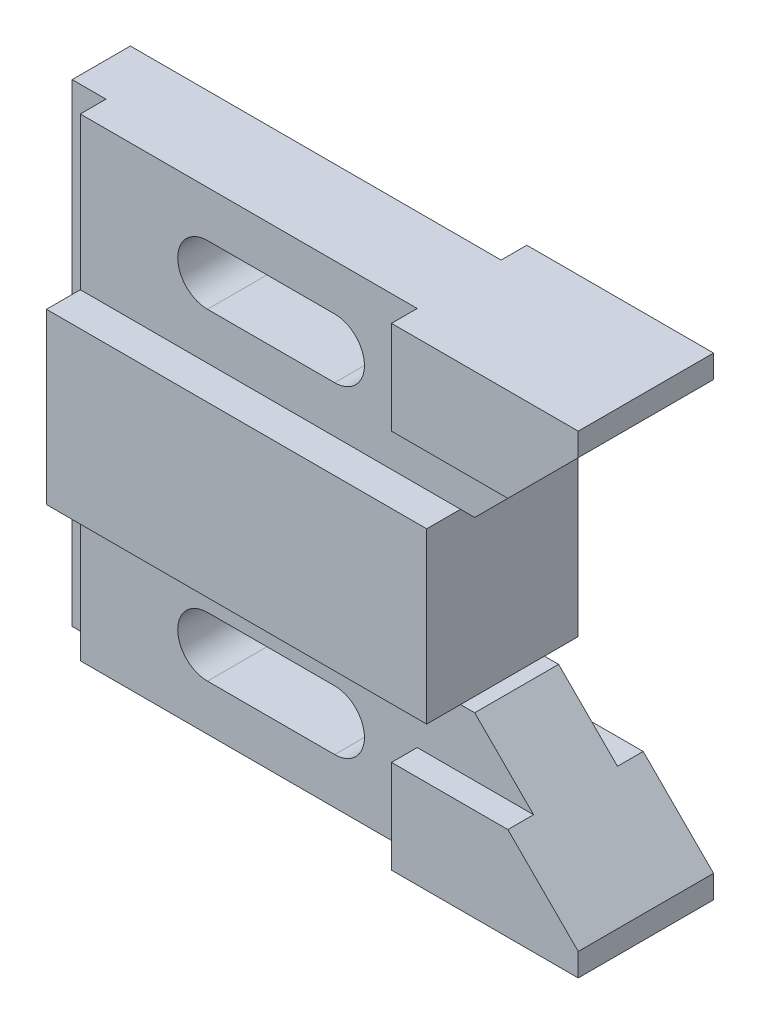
from build123d import *

# Parameters (mm, degrees)
BOSS_EXTRUDE1_DEPTH = 7.874
BOSS_EXTRUDE2_DEPTH = 4.826
SKETCH3_W           = 6.35
SKETCH3_H           = 88.9
CUT_EXTRUDE1_DEPTH  = 4.826
SKETCH4_W           = 71.374
SKETCH4_H           = 31.75
BOSS_EXTRUDE3_DEPTH = 6.35
SKETCH5_W           = 6.35
SKETCH5_H           = 31.75
BOSS_EXTRUDE4_DEPTH = 6.35


with BuildPart() as part:
    # Sketch1 → Boss-Extrude1 (new body)
    with BuildSketch(Plane.XY):
        Polygon((0, 0), (0, -88.9), (104.648, -88.9), (104.648, -84.582531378), (80.390468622, -60.325), (77.724, -60.325), (77.724, -44.45), (77.724, -28.575), (80.390468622, -28.575), (104.648, -4.317468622), (104.648, 0), align=None)
        with BuildLine():
            Line((30.226, -8.636), (54.102, -8.636))
            ThreePointArc((54.102, -8.636), (59.69, -14.224), (54.102, -19.812))
            Line((54.102, -19.812), (30.226, -19.812))
            ThreePointArc((30.226, -19.812), (24.638, -14.224), (30.226, -8.636))
        make_face(mode=Mode.SUBTRACT)
        with BuildLine():
            Line((30.226, -69.088), (54.102, -69.088))
            ThreePointArc((54.102, -69.088), (59.69, -74.676), (54.102, -80.264))
            Line((54.102, -80.264), (30.226, -80.264))
            ThreePointArc((30.226, -80.264), (24.638, -74.676), (30.226, -69.088))
        make_face(mode=Mode.SUBTRACT)
    boss_extrude1 = extrude(amount=BOSS_EXTRUDE1_DEPTH)

    # Sketch2 → Boss-Extrude2 (add)
    with BuildSketch(Plane.XY.offset(7.874)):
        Polygon((69.596, 0), (69.596, -17.526), (91.439468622, -17.526), (104.648, -4.317468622), (104.648, 0), align=None)
        Polygon((69.596, -71.374), (69.596, -88.9), (104.648, -88.9), (104.648, -84.582531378), (91.439468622, -71.374), align=None)
    boss_extrude2 = extrude(amount=BOSS_EXTRUDE2_DEPTH)

    # Sketch3 → Cut-Extrude1 (cut)
    with BuildSketch(Plane.XY.offset(7.874)):
        with Locations((3.175, -44.45)):
            Rectangle(SKETCH3_W, SKETCH3_H)
    extrude(amount=-CUT_EXTRUDE1_DEPTH, mode=Mode.SUBTRACT)

    # Sketch4 → Boss-Extrude3 (add)
    with BuildSketch(Plane.XY.offset(7.874)):
        with Locations((42.037, -44.45)):
            Rectangle(SKETCH4_W, SKETCH4_H)
    boss_extrude3 = extrude(amount=BOSS_EXTRUDE3_DEPTH)

    # Mirror2: Boss-Extrude1, Boss-Extrude2, Boss-Extrude3 across plane
    add(boss_extrude1.mirror(Plane.XY))
    add(boss_extrude2.mirror(Plane.XY))
    add(boss_extrude3.mirror(Plane.XY))

    # Sketch5 → Boss-Extrude4 (add)
    with BuildSketch(Plane.ZY.offset(-6.35)):
        with Locations((-11.049, -44.45)):
            Rectangle(SKETCH5_W, SKETCH5_H)
    extrude(amount=BOSS_EXTRUDE4_DEPTH)


solid = part.part
